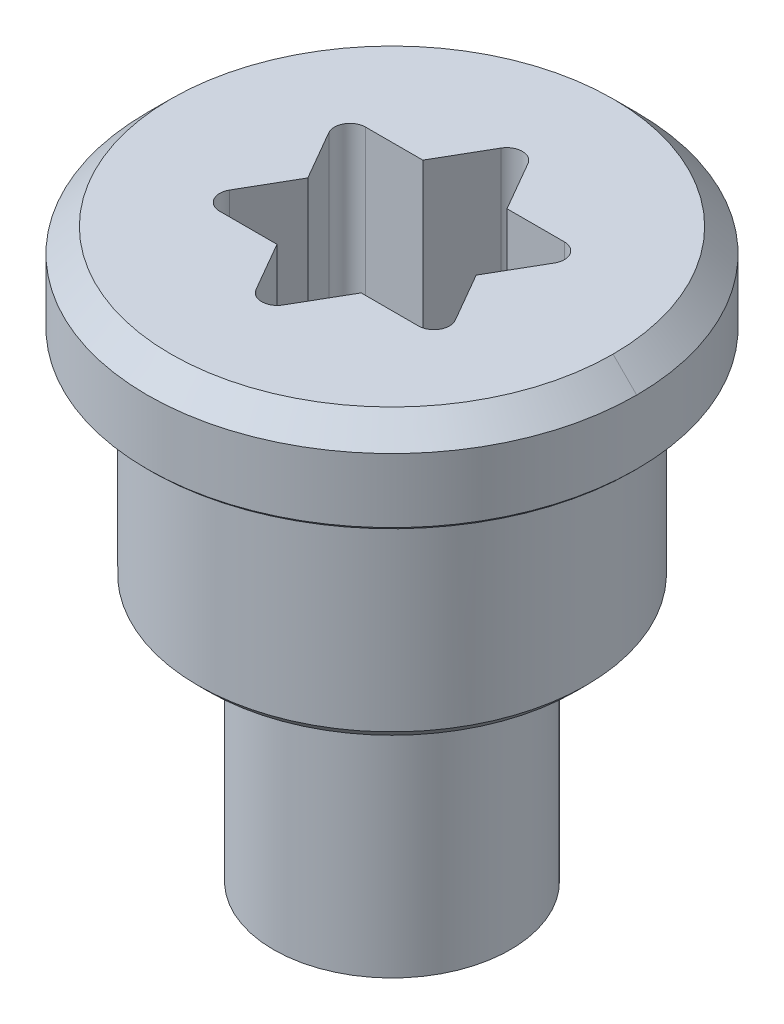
ISO-10303-21;
HEADER;
FILE_DESCRIPTION(('STEP AP214'),'2;1');
FILE_NAME('part.step','',(''),(''),'','','');
FILE_SCHEMA(('AUTOMOTIVE_DESIGN { 1 0 10303 214 1 1 1 1 }'));
ENDSEC;
DATA;
#1=APPLICATION_CONTEXT('core data for automotive mechanical design processes');
#2=APPLICATION_PROTOCOL_DEFINITION('international standard','automotive_design',2000,#1);
#3=PRODUCT_CONTEXT('',#1,'mechanical');
#4=PRODUCT('Part','Part','',(#3));
#5=PRODUCT_RELATED_PRODUCT_CATEGORY('part','',(#4));
#6=PRODUCT_DEFINITION_FORMATION('','',#4);
#7=PRODUCT_DEFINITION_CONTEXT('part definition',#1,'design');
#8=PRODUCT_DEFINITION('design','',#6,#7);
#9=PRODUCT_DEFINITION_SHAPE('','',#8);
#10=(LENGTH_UNIT() NAMED_UNIT(*) SI_UNIT(.MILLI.,.METRE.));
#11=(NAMED_UNIT(*) PLANE_ANGLE_UNIT() SI_UNIT($,.RADIAN.));
#12=(NAMED_UNIT(*) SI_UNIT($,.STERADIAN.) SOLID_ANGLE_UNIT());
#13=UNCERTAINTY_MEASURE_WITH_UNIT(LENGTH_MEASURE(1.E-05),#10,'distance_accuracy_value','');
#14=(GEOMETRIC_REPRESENTATION_CONTEXT(3) GLOBAL_UNCERTAINTY_ASSIGNED_CONTEXT((#13)) GLOBAL_UNIT_ASSIGNED_CONTEXT((#10,
#11,#12)) REPRESENTATION_CONTEXT('',''));
#15=CARTESIAN_POINT('',(0.,0.,0.));
#16=DIRECTION('',(0.,0.,1.));
#17=DIRECTION('',(1.,0.,0.));
#18=AXIS2_PLACEMENT_3D('',#15,#16,#17);
#19=CARTESIAN_POINT('',(77.52479714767,3.931380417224,-22.28021952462));
#20=DIRECTION('',(0.,0.,1.));
#21=DIRECTION('',(-1.,0.,0.));
#22=AXIS2_PLACEMENT_3D('',#19,#20,#21);
#23=PLANE('',#22);
#24=DIRECTION('',(0.,1.,0.));
#25=VECTOR('',#24,1.);
#26=CARTESIAN_POINT('',(76.6592854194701,2.631380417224,-22.2802195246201));
#27=LINE('',#26,#25);
#28=CARTESIAN_POINT('',(76.65928541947,1.381380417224,-22.28021952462));
#29=VERTEX_POINT('',#28);
#30=CARTESIAN_POINT('',(76.65928541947,3.881380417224,-22.28021952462));
#31=VERTEX_POINT('',#30);
#32=EDGE_CURVE('E213',#29,#31,#27,.T.);
#33=ORIENTED_EDGE('',*,*,#32,.T.);
#34=DIRECTION('',(-1.,0.,0.));
#35=VECTOR('',#34,1.);
#36=CARTESIAN_POINT('',(77.08355587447,3.881380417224,-22.28021952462));
#37=LINE('',#36,#35);
#38=CARTESIAN_POINT('',(77.5078263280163,3.88138041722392,-22.2802195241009));
#39=VERTEX_POINT('',#38);
#40=EDGE_CURVE('E220',#39,#31,#37,.T.);
#41=ORIENTED_EDGE('',*,*,#40,.F.);
#42=DIRECTION('',(0.,1.,0.));
#43=VECTOR('',#42,1.);
#44=CARTESIAN_POINT('',(77.5078263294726,2.631380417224,-22.2802195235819));
#45=LINE('',#44,#43);
#46=CARTESIAN_POINT('',(77.5078263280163,1.381380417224,-22.2802195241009));
#47=VERTEX_POINT('',#46);
#48=EDGE_CURVE('E185',#47,#39,#45,.T.);
#49=ORIENTED_EDGE('',*,*,#48,.F.);
#50=DIRECTION('',(1.,0.,0.));
#51=VECTOR('',#50,1.);
#52=CARTESIAN_POINT('',(77.08355587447,1.381380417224,-22.28021952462));
#53=LINE('',#52,#51);
#54=EDGE_CURVE('E180',#29,#47,#53,.T.);
#55=ORIENTED_EDGE('',*,*,#54,.F.);
#56=EDGE_LOOP('',(#33,#41,#49,#55));
#57=FACE_BOUND('',#56,.T.);
#58=ADVANCED_FACE('F15',(#57),#23,.F.);
#59=CARTESIAN_POINT('',(76.66777082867,3.931380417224,-22.29491668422));
#60=DIRECTION('',(0.866025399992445,0.,0.500000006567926));
#61=DIRECTION('',(-0.500000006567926,0.,0.866025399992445));
#62=AXIS2_PLACEMENT_3D('',#59,#60,#61);
#63=PLANE('',#62);
#64=DIRECTION('',(0.,-1.,0.));
#65=VECTOR('',#64,1.);
#66=CARTESIAN_POINT('',(76.23501495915,2.631380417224,-21.5453615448));
#67=LINE('',#66,#65);
#68=CARTESIAN_POINT('',(76.2350149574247,3.88138041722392,-21.5453615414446));
#69=VERTEX_POINT('',#68);
#70=CARTESIAN_POINT('',(76.2350149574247,1.381380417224,-21.5453615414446));
#71=VERTEX_POINT('',#70);
#72=EDGE_CURVE('E207',#69,#71,#67,.T.);
#73=ORIENTED_EDGE('',*,*,#72,.F.);
#74=DIRECTION('',(-0.500000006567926,0.,0.866025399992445));
#75=VECTOR('',#74,1.);
#76=CARTESIAN_POINT('',(76.44715018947,3.881380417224,-21.91279053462));
#77=LINE('',#76,#75);
#78=EDGE_CURVE('E211',#31,#69,#77,.T.);
#79=ORIENTED_EDGE('',*,*,#78,.F.);
#80=ORIENTED_EDGE('',*,*,#32,.F.);
#81=DIRECTION('',(0.500000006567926,0.,-0.866025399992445));
#82=VECTOR('',#81,1.);
#83=CARTESIAN_POINT('',(76.44715018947,1.381380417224,-21.91279053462));
#84=LINE('',#83,#82);
#85=EDGE_CURVE('E186',#71,#29,#84,.T.);
#86=ORIENTED_EDGE('',*,*,#85,.F.);
#87=EDGE_LOOP('',(#73,#79,#80,#86));
#88=FACE_BOUND('',#87,.T.);
#89=ADVANCED_FACE('F590',(#88),#63,.F.);
#90=CARTESIAN_POINT('',(77.50782632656,1.381380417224,-22.51036153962));
#91=DIRECTION('',(0.,1.,0.));
#92=DIRECTION('',(0.,0.,1.));
#93=AXIS2_PLACEMENT_3D('',#90,#91,#92);
#94=CYLINDRICAL_SURFACE('',#93,0.230142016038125);
#95=ORIENTED_EDGE('',*,*,#48,.T.);
#96=CARTESIAN_POINT('',(77.50782632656,3.88138041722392,-22.51036153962));
#97=DIRECTION('',(0.,1.,0.));
#98=DIRECTION('',(0.,0.,1.));
#99=AXIS2_PLACEMENT_3D('',#96,#97,#98);
#100=CIRCLE('',#99,0.230142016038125);
#101=CARTESIAN_POINT('',(77.7071351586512,3.88138041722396,-22.6254325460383));
#102=VERTEX_POINT('',#101);
#103=EDGE_CURVE('E199',#39,#102,#100,.T.);
#104=ORIENTED_EDGE('',*,*,#103,.T.);
#105=DIRECTION('',(0.,-1.,0.));
#106=VECTOR('',#105,1.);
#107=CARTESIAN_POINT('',(77.70713515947,2.631380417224,-22.62543254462));
#108=LINE('',#107,#106);
#109=CARTESIAN_POINT('',(77.7071351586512,1.381380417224,-22.6254325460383));
#110=VERTEX_POINT('',#109);
#111=EDGE_CURVE('E191',#102,#110,#108,.T.);
#112=ORIENTED_EDGE('',*,*,#111,.T.);
#113=CARTESIAN_POINT('',(77.50782632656,1.381380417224,-22.51036153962));
#114=DIRECTION('',(0.,1.,0.));
#115=DIRECTION('',(0.,0.,1.));
#116=AXIS2_PLACEMENT_3D('',#113,#114,#115);
#117=CIRCLE('',#116,0.230142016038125);
#118=EDGE_CURVE('E19',#110,#47,#117,.F.);
#119=ORIENTED_EDGE('',*,*,#118,.T.);
#120=EDGE_LOOP('',(#95,#104,#112,#119));
#121=FACE_BOUND('',#120,.T.);
#122=ADVANCED_FACE('F197',(#121),#94,.F.);
#123=CARTESIAN_POINT('',(76.03570612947,1.381380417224,-21.66043254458));
#124=DIRECTION('',(0.,1.,0.));
#125=DIRECTION('',(0.,0.,1.));
#126=AXIS2_PLACEMENT_3D('',#123,#124,#125);
#127=CYLINDRICAL_SURFACE('',#126,0.230142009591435);
#128=DIRECTION('',(0.,-1.,0.));
#129=VECTOR('',#128,1.);
#130=CARTESIAN_POINT('',(75.83639729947,2.631380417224,-21.5453615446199));
#131=LINE('',#130,#129);
#132=CARTESIAN_POINT('',(75.8363973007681,3.88138041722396,-21.5453615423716));
#133=VERTEX_POINT('',#132);
#134=CARTESIAN_POINT('',(75.8363973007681,1.381380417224,-21.5453615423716));
#135=VERTEX_POINT('',#134);
#136=EDGE_CURVE('E195',#133,#135,#131,.T.);
#137=ORIENTED_EDGE('',*,*,#136,.F.);
#138=CARTESIAN_POINT('',(76.03570612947,3.88138041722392,-21.66043254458));
#139=DIRECTION('',(0.,1.,0.));
#140=DIRECTION('',(0.,0.,1.));
#141=AXIS2_PLACEMENT_3D('',#138,#139,#140);
#142=CIRCLE('',#141,0.230142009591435);
#143=EDGE_CURVE('E202',#133,#69,#142,.T.);
#144=ORIENTED_EDGE('',*,*,#143,.T.);
#145=ORIENTED_EDGE('',*,*,#72,.T.);
#146=CARTESIAN_POINT('',(76.03570612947,1.381380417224,-21.66043254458));
#147=DIRECTION('',(0.,1.,0.));
#148=DIRECTION('',(0.,0.,1.));
#149=AXIS2_PLACEMENT_3D('',#146,#147,#148);
#150=CIRCLE('',#149,0.230142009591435);
#151=EDGE_CURVE('E210',#71,#135,#150,.F.);
#152=ORIENTED_EDGE('',*,*,#151,.T.);
#153=EDGE_LOOP('',(#137,#144,#145,#152));
#154=FACE_BOUND('',#153,.T.);
#155=ADVANCED_FACE('F324',(#154),#127,.F.);
#156=CARTESIAN_POINT('',(77.27437929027,3.931380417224,-23.37498769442));
#157=DIRECTION('',(0.866025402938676,0.,-0.500000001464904));
#158=DIRECTION('',(0.500000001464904,0.,0.866025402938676));
#159=AXIS2_PLACEMENT_3D('',#156,#157,#158);
#160=PLANE('',#159);
#161=ORIENTED_EDGE('',*,*,#111,.F.);
#162=DIRECTION('',(0.500000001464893,0.,0.866025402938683));
#163=VECTOR('',#162,1.);
#164=CARTESIAN_POINT('',(77.49499992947,3.881380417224,-22.99286153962));
#165=LINE('',#164,#163);
#166=CARTESIAN_POINT('',(77.28286469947,3.881380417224,-23.36029053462));
#167=VERTEX_POINT('',#166);
#168=EDGE_CURVE('E200',#167,#102,#165,.T.);
#169=ORIENTED_EDGE('',*,*,#168,.F.);
#170=DIRECTION('',(0.,-1.,0.));
#171=VECTOR('',#170,1.);
#172=CARTESIAN_POINT('',(77.28286469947,2.631380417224,-23.36029053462));
#173=LINE('',#172,#171);
#174=CARTESIAN_POINT('',(77.28286469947,1.381380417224,-23.36029053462));
#175=VERTEX_POINT('',#174);
#176=EDGE_CURVE('E194',#167,#175,#173,.T.);
#177=ORIENTED_EDGE('',*,*,#176,.T.);
#178=DIRECTION('',(-0.500000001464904,0.,-0.866025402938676));
#179=VECTOR('',#178,1.);
#180=CARTESIAN_POINT('',(77.49499992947,1.381380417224,-22.99286153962));
#181=LINE('',#180,#179);
#182=EDGE_CURVE('E177',#110,#175,#181,.T.);
#183=ORIENTED_EDGE('',*,*,#182,.F.);
#184=EDGE_LOOP('',(#161,#169,#177,#183));
#185=FACE_BOUND('',#184,.T.);
#186=ADVANCED_FACE('F190',(#185),#160,.F.);
#187=CARTESIAN_POINT('',(74.2105061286,-4.518619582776,-25.18549053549));
#188=DIRECTION('',(0.,-1.,0.));
#189=DIRECTION('',(1.,0.,0.));
#190=AXIS2_PLACEMENT_3D('',#187,#188,#189);
#191=PLANE('',#190);
#192=CARTESIAN_POINT('',(76.03570612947,-4.51861958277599,-23.36029053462));
#193=DIRECTION('',(0.,1.,0.));
#194=DIRECTION('',(0.,0.,1.));
#195=AXIS2_PLACEMENT_3D('',#192,#193,#194);
#196=CIRCLE('',#195,1.75500000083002);
#197=CARTESIAN_POINT('',(76.03570612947,-4.51861958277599,-21.60529053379));
#198=VERTEX_POINT('',#197);
#199=EDGE_CURVE('E313',#198,#198,#196,.F.);
#200=ORIENTED_EDGE('',*,*,#199,.T.);
#201=EDGE_LOOP('',(#200));
#202=FACE_BOUND('',#201,.T.);
#203=ADVANCED_FACE('F599',(#202),#191,.T.);
#204=CARTESIAN_POINT('',(75.84488270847,1.331380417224,-21.53066438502));
#205=DIRECTION('',(0.866025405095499,0.,-0.499999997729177));
#206=DIRECTION('',(-0.499999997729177,0.,-0.866025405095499));
#207=AXIS2_PLACEMENT_3D('',#204,#205,#206);
#208=PLANE('',#207);
#209=DIRECTION('',(0.,1.,0.));
#210=VECTOR('',#209,1.);
#211=CARTESIAN_POINT('',(75.41212684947,2.631380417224,-22.28021952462));
#212=LINE('',#211,#210);
#213=CARTESIAN_POINT('',(75.41212684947,1.381380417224,-22.28021952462));
#214=VERTEX_POINT('',#213);
#215=CARTESIAN_POINT('',(75.41212684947,3.881380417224,-22.28021952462));
#216=VERTEX_POINT('',#215);
#217=EDGE_CURVE('E316',#214,#216,#212,.T.);
#218=ORIENTED_EDGE('',*,*,#217,.T.);
#219=DIRECTION('',(0.499999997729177,0.,0.866025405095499));
#220=VECTOR('',#219,1.);
#221=CARTESIAN_POINT('',(75.62426207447,3.881380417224,-21.91279053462));
#222=LINE('',#221,#220);
#223=EDGE_CURVE('E333',#216,#133,#222,.T.);
#224=ORIENTED_EDGE('',*,*,#223,.T.);
#225=ORIENTED_EDGE('',*,*,#136,.T.);
#226=DIRECTION('',(-0.499999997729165,0.,-0.866025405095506));
#227=VECTOR('',#226,1.);
#228=CARTESIAN_POINT('',(75.62426207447,1.381380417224,-21.91279053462));
#229=LINE('',#228,#227);
#230=EDGE_CURVE('E331',#135,#214,#229,.T.);
#231=ORIENTED_EDGE('',*,*,#230,.T.);
#232=EDGE_LOOP('',(#218,#224,#225,#231));
#233=FACE_BOUND('',#232,.T.);
#234=ADVANCED_FACE('F330',(#233),#208,.T.);
#235=CARTESIAN_POINT('',(77.71562056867,3.931380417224,-24.10984568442));
#236=DIRECTION('',(0.866025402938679,0.,0.500000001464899));
#237=DIRECTION('',(-0.500000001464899,0.,0.866025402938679));
#238=AXIS2_PLACEMENT_3D('',#235,#236,#237);
#239=PLANE('',#238);
#240=ORIENTED_EDGE('',*,*,#176,.F.);
#241=DIRECTION('',(-0.500000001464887,0.,0.866025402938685));
#242=VECTOR('',#241,1.);
#243=CARTESIAN_POINT('',(77.49499992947,3.881380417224,-23.72771952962));
#244=LINE('',#243,#242);
#245=CARTESIAN_POINT('',(77.7071351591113,3.88138041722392,-24.0951485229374));
#246=VERTEX_POINT('',#245);
#247=EDGE_CURVE('E337',#246,#167,#244,.T.);
#248=ORIENTED_EDGE('',*,*,#247,.F.);
#249=DIRECTION('',(0.,1.,0.));
#250=VECTOR('',#249,1.);
#251=CARTESIAN_POINT('',(77.7071351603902,2.631380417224,-24.0951485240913));
#252=LINE('',#251,#250);
#253=CARTESIAN_POINT('',(77.7071351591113,1.381380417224,-24.0951485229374));
#254=VERTEX_POINT('',#253);
#255=EDGE_CURVE('E309',#254,#246,#252,.T.);
#256=ORIENTED_EDGE('',*,*,#255,.F.);
#257=DIRECTION('',(0.500000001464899,0.,-0.866025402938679));
#258=VECTOR('',#257,1.);
#259=CARTESIAN_POINT('',(77.49499992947,1.381380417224,-23.72771952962));
#260=LINE('',#259,#258);
#261=EDGE_CURVE('E317',#175,#254,#260,.T.);
#262=ORIENTED_EDGE('',*,*,#261,.F.);
#263=EDGE_LOOP('',(#240,#248,#256,#262));
#264=FACE_BOUND('',#263,.T.);
#265=ADVANCED_FACE('F513',(#264),#239,.F.);
#266=CARTESIAN_POINT('',(76.03570612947,-4.51861958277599,-23.36029053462));
#267=DIRECTION('',(0.,1.,0.));
#268=DIRECTION('',(0.,0.,1.));
#269=AXIS2_PLACEMENT_3D('',#266,#267,#268);
#270=CYLINDRICAL_SURFACE('',#269,1.75500000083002);
#271=CARTESIAN_POINT('',(76.03570612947,-0.718619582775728,-23.36029053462));
#272=DIRECTION('',(0.,1.,0.));
#273=DIRECTION('',(0.,0.,1.));
#274=AXIS2_PLACEMENT_3D('',#271,#272,#273);
#275=CIRCLE('',#274,1.75500000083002);
#276=CARTESIAN_POINT('',(76.03570612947,-0.718619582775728,-21.60529053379));
#277=VERTEX_POINT('',#276);
#278=EDGE_CURVE('E304',#277,#277,#275,.T.);
#279=ORIENTED_EDGE('',*,*,#278,.F.);
#280=EDGE_LOOP('',(#279));
#281=FACE_BOUND('',#280,.T.);
#282=ORIENTED_EDGE('',*,*,#199,.F.);
#283=EDGE_LOOP('',(#282));
#284=FACE_BOUND('',#283,.T.);
#285=ADVANCED_FACE('F531',(#281,#284),#270,.T.);
#286=CARTESIAN_POINT('',(75.42909766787,3.931380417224,-22.28021952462));
#287=DIRECTION('',(0.,0.,1.));
#288=DIRECTION('',(-1.,0.,0.));
#289=AXIS2_PLACEMENT_3D('',#286,#287,#288);
#290=PLANE('',#289);
#291=DIRECTION('',(0.,-1.,0.));
#292=VECTOR('',#291,1.);
#293=CARTESIAN_POINT('',(74.56358592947,2.631380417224,-22.28021952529));
#294=LINE('',#293,#292);
#295=CARTESIAN_POINT('',(74.563585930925,3.88138041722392,-22.280219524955));
#296=VERTEX_POINT('',#295);
#297=CARTESIAN_POINT('',(74.563585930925,1.381380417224,-22.280219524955));
#298=VERTEX_POINT('',#297);
#299=EDGE_CURVE('E303',#296,#298,#294,.T.);
#300=ORIENTED_EDGE('',*,*,#299,.F.);
#301=DIRECTION('',(-1.,0.,0.));
#302=VECTOR('',#301,1.);
#303=CARTESIAN_POINT('',(74.98785638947,3.881380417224,-22.28021952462));
#304=LINE('',#303,#302);
#305=EDGE_CURVE('E363',#216,#296,#304,.T.);
#306=ORIENTED_EDGE('',*,*,#305,.F.);
#307=ORIENTED_EDGE('',*,*,#217,.F.);
#308=DIRECTION('',(1.,0.,0.));
#309=VECTOR('',#308,1.);
#310=CARTESIAN_POINT('',(74.98785638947,1.381380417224,-22.28021952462));
#311=LINE('',#310,#309);
#312=EDGE_CURVE('E312',#298,#214,#311,.T.);
#313=ORIENTED_EDGE('',*,*,#312,.F.);
#314=EDGE_LOOP('',(#300,#306,#307,#313));
#315=FACE_BOUND('',#314,.T.);
#316=ADVANCED_FACE('F529',(#315),#290,.F.);
#317=CARTESIAN_POINT('',(77.50782632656,1.381380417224,-24.21021952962));
#318=DIRECTION('',(0.,1.,0.));
#319=DIRECTION('',(0.,0.,1.));
#320=AXIS2_PLACEMENT_3D('',#317,#318,#319);
#321=CYLINDRICAL_SURFACE('',#320,0.230142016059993);
#322=ORIENTED_EDGE('',*,*,#255,.T.);
#323=CARTESIAN_POINT('',(77.50782632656,3.88138041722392,-24.21021952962));
#324=DIRECTION('',(0.,1.,0.));
#325=DIRECTION('',(0.,0.,1.));
#326=AXIS2_PLACEMENT_3D('',#323,#324,#325);
#327=CIRCLE('',#326,0.230142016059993);
#328=CARTESIAN_POINT('',(77.507826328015,3.88138041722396,-24.44036154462));
#329=VERTEX_POINT('',#328);
#330=EDGE_CURVE('E307',#246,#329,#327,.T.);
#331=ORIENTED_EDGE('',*,*,#330,.T.);
#332=DIRECTION('',(0.,1.,0.));
#333=VECTOR('',#332,1.);
#334=CARTESIAN_POINT('',(77.50782632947,2.631380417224,-24.44036154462));
#335=LINE('',#334,#333);
#336=CARTESIAN_POINT('',(77.507826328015,1.381380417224,-24.44036154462));
#337=VERTEX_POINT('',#336);
#338=EDGE_CURVE('E373',#337,#329,#335,.T.);
#339=ORIENTED_EDGE('',*,*,#338,.F.);
#340=CARTESIAN_POINT('',(77.50782632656,1.381380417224,-24.21021952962));
#341=DIRECTION('',(0.,1.,0.));
#342=DIRECTION('',(0.,0.,1.));
#343=AXIS2_PLACEMENT_3D('',#340,#341,#342);
#344=CIRCLE('',#343,0.230142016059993);
#345=EDGE_CURVE('E310',#337,#254,#344,.F.);
#346=ORIENTED_EDGE('',*,*,#345,.T.);
#347=EDGE_LOOP('',(#322,#331,#339,#346));
#348=FACE_BOUND('',#347,.T.);
#349=ADVANCED_FACE('F510',(#348),#321,.F.);
#350=CARTESIAN_POINT('',(73.20170620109,-0.7186195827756,-26.194290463));
#351=DIRECTION('',(0.,-1.,0.));
#352=DIRECTION('',(1.,0.,0.));
#353=AXIS2_PLACEMENT_3D('',#350,#351,#352);
#354=PLANE('',#353);
#355=ORIENTED_EDGE('',*,*,#278,.T.);
#356=EDGE_LOOP('',(#355));
#357=FACE_BOUND('',#356,.T.);
#358=CARTESIAN_POINT('',(76.03570612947,-0.71861958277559,-23.36029053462));
#359=DIRECTION('',(0.,1.,0.));
#360=DIRECTION('',(0.,0.,1.));
#361=AXIS2_PLACEMENT_3D('',#358,#359,#360);
#362=CIRCLE('',#361,2.72499993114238);
#363=CARTESIAN_POINT('',(78.7607060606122,-0.71861958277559,-23.3602905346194));
#364=VERTEX_POINT('',#363);
#365=CARTESIAN_POINT('',(73.3107061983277,-0.71861958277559,-23.36029053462));
#366=VERTEX_POINT('',#365);
#367=EDGE_CURVE('E294',#364,#366,#362,.F.);
#368=ORIENTED_EDGE('',*,*,#367,.T.);
#369=CARTESIAN_POINT('',(76.03570612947,-0.71861958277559,-23.36029053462));
#370=DIRECTION('',(0.,1.,0.));
#371=DIRECTION('',(0.,0.,1.));
#372=AXIS2_PLACEMENT_3D('',#369,#370,#371);
#373=CIRCLE('',#372,2.72499993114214);
#374=EDGE_CURVE('E289',#366,#364,#373,.F.);
#375=ORIENTED_EDGE('',*,*,#374,.T.);
#376=EDGE_LOOP('',(#368,#375));
#377=FACE_BOUND('',#376,.T.);
#378=ADVANCED_FACE('F538',(#357,#377),#354,.T.);
#379=CARTESIAN_POINT('',(74.56358593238,1.381380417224,-22.51036153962));
#380=DIRECTION('',(0.,1.,0.));
#381=DIRECTION('',(0.,0.,1.));
#382=AXIS2_PLACEMENT_3D('',#379,#380,#381);
#383=CYLINDRICAL_SURFACE('',#382,0.230142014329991);
#384=DIRECTION('',(0.,-1.,0.));
#385=VECTOR('',#384,1.);
#386=CARTESIAN_POINT('',(74.36427709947,2.631380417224,-22.62543254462));
#387=LINE('',#386,#385);
#388=CARTESIAN_POINT('',(74.3642771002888,3.88138041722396,-22.6254325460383));
#389=VERTEX_POINT('',#388);
#390=CARTESIAN_POINT('',(74.3642771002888,1.381380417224,-22.6254325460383));
#391=VERTEX_POINT('',#390);
#392=EDGE_CURVE('E376',#389,#391,#387,.T.);
#393=ORIENTED_EDGE('',*,*,#392,.F.);
#394=CARTESIAN_POINT('',(74.56358593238,3.88138041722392,-22.51036153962));
#395=DIRECTION('',(0.,1.,0.));
#396=DIRECTION('',(0.,0.,1.));
#397=AXIS2_PLACEMENT_3D('',#394,#395,#396);
#398=CIRCLE('',#397,0.230142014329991);
#399=EDGE_CURVE('E297',#389,#296,#398,.T.);
#400=ORIENTED_EDGE('',*,*,#399,.T.);
#401=ORIENTED_EDGE('',*,*,#299,.T.);
#402=CARTESIAN_POINT('',(74.56358593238,1.381380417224,-22.51036153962));
#403=DIRECTION('',(0.,1.,0.));
#404=DIRECTION('',(0.,0.,1.));
#405=AXIS2_PLACEMENT_3D('',#402,#403,#404);
#406=CIRCLE('',#405,0.230142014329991);
#407=EDGE_CURVE('E301',#298,#391,#406,.F.);
#408=ORIENTED_EDGE('',*,*,#407,.T.);
#409=EDGE_LOOP('',(#393,#400,#401,#408));
#410=FACE_BOUND('',#409,.T.);
#411=ADVANCED_FACE('F526',(#410),#383,.F.);
#412=CARTESIAN_POINT('',(76.64231460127,1.331380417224,-24.44036154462));
#413=DIRECTION('',(0.,0.,1.));
#414=DIRECTION('',(1.,0.,0.));
#415=AXIS2_PLACEMENT_3D('',#412,#413,#414);
#416=PLANE('',#415);
#417=ORIENTED_EDGE('',*,*,#338,.T.);
#418=DIRECTION('',(-1.,0.,0.));
#419=VECTOR('',#418,1.);
#420=CARTESIAN_POINT('',(77.08355587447,3.881380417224,-24.44036154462));
#421=LINE('',#420,#419);
#422=CARTESIAN_POINT('',(76.65928541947,3.881380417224,-24.44036154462));
#423=VERTEX_POINT('',#422);
#424=EDGE_CURVE('E296',#329,#423,#421,.T.);
#425=ORIENTED_EDGE('',*,*,#424,.T.);
#426=DIRECTION('',(0.,-1.,0.));
#427=VECTOR('',#426,1.);
#428=CARTESIAN_POINT('',(76.65928541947,2.631380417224,-24.4403615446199));
#429=LINE('',#428,#427);
#430=CARTESIAN_POINT('',(76.65928541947,1.381380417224,-24.44036154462));
#431=VERTEX_POINT('',#430);
#432=EDGE_CURVE('E388',#423,#431,#429,.T.);
#433=ORIENTED_EDGE('',*,*,#432,.T.);
#434=DIRECTION('',(1.,0.,0.));
#435=VECTOR('',#434,1.);
#436=CARTESIAN_POINT('',(77.08355587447,1.381380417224,-24.44036154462));
#437=LINE('',#436,#435);
#438=EDGE_CURVE('E300',#431,#337,#437,.T.);
#439=ORIENTED_EDGE('',*,*,#438,.T.);
#440=EDGE_LOOP('',(#417,#425,#433,#439));
#441=FACE_BOUND('',#440,.T.);
#442=ADVANCED_FACE('F505',(#441),#416,.T.);
#443=CARTESIAN_POINT('',(76.03570612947,-0.71861958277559,-23.36029053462));
#444=DIRECTION('',(0.,1.,0.));
#445=DIRECTION('',(0.,0.,1.));
#446=AXIS2_PLACEMENT_3D('',#443,#444,#445);
#447=CONICAL_SURFACE('',#446,2.72499993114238,0.785398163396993);
#448=ORIENTED_EDGE('',*,*,#367,.F.);
#449=DIRECTION('',(0.707106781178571,0.707106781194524,1.42134599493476E-13));
#450=VECTOR('',#449,1.);
#451=CARTESIAN_POINT('',(78.8357060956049,-0.64361954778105,-23.3602905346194));
#452=LINE('',#451,#450);
#453=CARTESIAN_POINT('',(78.9107061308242,-0.568619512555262,-23.3602905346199));
#454=VERTEX_POINT('',#453);
#455=EDGE_CURVE('E292',#364,#454,#452,.T.);
#456=ORIENTED_EDGE('',*,*,#455,.T.);
#457=CARTESIAN_POINT('',(76.03570612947,-0.568619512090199,-23.36029053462));
#458=DIRECTION('',(0.,1.,0.));
#459=DIRECTION('',(-1.,0.,0.));
#460=AXIS2_PLACEMENT_3D('',#457,#458,#459);
#461=CIRCLE('',#460,2.87500000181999);
#462=CARTESIAN_POINT('',(73.160706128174,-0.568619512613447,-23.3602905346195));
#463=VERTEX_POINT('',#462);
#464=EDGE_CURVE('E405',#454,#463,#461,.F.);
#465=ORIENTED_EDGE('',*,*,#464,.T.);
#466=DIRECTION('',(0.707106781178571,-0.707106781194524,0.));
#467=VECTOR('',#466,1.);
#468=CARTESIAN_POINT('',(73.235706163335,-0.64361954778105,-23.36029053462));
#469=LINE('',#468,#467);
#470=EDGE_CURVE('E293',#463,#366,#469,.T.);
#471=ORIENTED_EDGE('',*,*,#470,.T.);
#472=EDGE_LOOP('',(#448,#456,#465,#471));
#473=FACE_BOUND('',#472,.T.);
#474=ADVANCED_FACE('F579',(#473),#447,.T.);
#475=CARTESIAN_POINT('',(76.03570612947,-0.718619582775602,-23.36029053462));
#476=DIRECTION('',(0.,1.,0.));
#477=DIRECTION('',(0.,0.,1.));
#478=AXIS2_PLACEMENT_3D('',#475,#476,#477);
#479=CONICAL_SURFACE('',#478,2.72499993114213,0.78539816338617);
#480=ORIENTED_EDGE('',*,*,#455,.F.);
#481=ORIENTED_EDGE('',*,*,#374,.F.);
#482=ORIENTED_EDGE('',*,*,#470,.F.);
#483=CARTESIAN_POINT('',(76.03570612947,-0.568619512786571,-23.36029053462));
#484=DIRECTION('',(0.,1.,0.));
#485=DIRECTION('',(1.,0.,0.));
#486=AXIS2_PLACEMENT_3D('',#483,#484,#485);
#487=CIRCLE('',#486,2.87500000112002);
#488=EDGE_CURVE('E286',#463,#454,#487,.F.);
#489=ORIENTED_EDGE('',*,*,#488,.T.);
#490=EDGE_LOOP('',(#480,#481,#482,#489));
#491=FACE_BOUND('',#490,.T.);
#492=ADVANCED_FACE('F576',(#491),#479,.T.);
#493=CARTESIAN_POINT('',(74.35579169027,1.331380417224,-22.61073538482));
#494=DIRECTION('',(0.866025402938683,0.,0.500000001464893));
#495=DIRECTION('',(0.500000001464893,0.,-0.866025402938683));
#496=AXIS2_PLACEMENT_3D('',#493,#494,#495);
#497=PLANE('',#496);
#498=DIRECTION('',(0.,-1.,0.));
#499=VECTOR('',#498,1.);
#500=CARTESIAN_POINT('',(74.78854755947,2.631380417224,-23.36029053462));
#501=LINE('',#500,#499);
#502=CARTESIAN_POINT('',(74.78854755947,3.881380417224,-23.36029053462));
#503=VERTEX_POINT('',#502);
#504=CARTESIAN_POINT('',(74.78854755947,1.381380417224,-23.36029053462));
#505=VERTEX_POINT('',#504);
#506=EDGE_CURVE('E280',#503,#505,#501,.T.);
#507=ORIENTED_EDGE('',*,*,#506,.F.);
#508=DIRECTION('',(-0.500000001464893,0.,0.866025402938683));
#509=VECTOR('',#508,1.);
#510=CARTESIAN_POINT('',(74.57641232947,3.881380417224,-22.99286153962));
#511=LINE('',#510,#509);
#512=EDGE_CURVE('E413',#503,#389,#511,.T.);
#513=ORIENTED_EDGE('',*,*,#512,.T.);
#514=ORIENTED_EDGE('',*,*,#392,.T.);
#515=DIRECTION('',(0.500000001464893,0.,-0.866025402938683));
#516=VECTOR('',#515,1.);
#517=CARTESIAN_POINT('',(74.57641232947,1.381380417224,-22.99286153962));
#518=LINE('',#517,#516);
#519=EDGE_CURVE('E379',#391,#505,#518,.T.);
#520=ORIENTED_EDGE('',*,*,#519,.T.);
#521=EDGE_LOOP('',(#507,#513,#514,#520));
#522=FACE_BOUND('',#521,.T.);
#523=ADVANCED_FACE('F523',(#522),#497,.T.);
#524=CARTESIAN_POINT('',(76.22652955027,3.931380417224,-25.18991668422));
#525=DIRECTION('',(0.866025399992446,0.,-0.500000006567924));
#526=DIRECTION('',(0.500000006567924,0.,0.866025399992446));
#527=AXIS2_PLACEMENT_3D('',#524,#525,#526);
#528=PLANE('',#527);
#529=ORIENTED_EDGE('',*,*,#432,.F.);
#530=DIRECTION('',(0.500000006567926,0.,0.866025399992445));
#531=VECTOR('',#530,1.);
#532=CARTESIAN_POINT('',(76.44715018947,3.881380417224,-24.80779053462));
#533=LINE('',#532,#531);
#534=CARTESIAN_POINT('',(76.2350149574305,3.88138041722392,-25.175219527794));
#535=VERTEX_POINT('',#534);
#536=EDGE_CURVE('E392',#535,#423,#533,.T.);
#537=ORIENTED_EDGE('',*,*,#536,.F.);
#538=DIRECTION('',(0.,1.,0.));
#539=VECTOR('',#538,1.);
#540=CARTESIAN_POINT('',(76.2350149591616,2.631380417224,-25.1752195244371));
#541=LINE('',#540,#539);
#542=CARTESIAN_POINT('',(76.2350149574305,1.381380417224,-25.175219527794));
#543=VERTEX_POINT('',#542);
#544=EDGE_CURVE('E277',#543,#535,#541,.T.);
#545=ORIENTED_EDGE('',*,*,#544,.F.);
#546=DIRECTION('',(-0.500000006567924,0.,-0.866025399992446));
#547=VECTOR('',#546,1.);
#548=CARTESIAN_POINT('',(76.44715018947,1.381380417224,-24.80779053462));
#549=LINE('',#548,#547);
#550=EDGE_CURVE('E391',#431,#543,#549,.T.);
#551=ORIENTED_EDGE('',*,*,#550,.F.);
#552=EDGE_LOOP('',(#529,#537,#545,#551));
#553=FACE_BOUND('',#552,.T.);
#554=ADVANCED_FACE('F502',(#553),#528,.F.);
#555=CARTESIAN_POINT('',(76.03570612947,-0.568619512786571,-23.36029053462));
#556=DIRECTION('',(0.,1.,0.));
#557=DIRECTION('',(0.,0.,1.));
#558=AXIS2_PLACEMENT_3D('',#555,#556,#557);
#559=CYLINDRICAL_SURFACE('',#558,2.87500000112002);
#560=CARTESIAN_POINT('',(76.03570612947,2.53138041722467,-23.36029053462));
#561=DIRECTION('',(0.,1.,0.));
#562=DIRECTION('',(0.,0.,1.));
#563=AXIS2_PLACEMENT_3D('',#560,#561,#562);
#564=CIRCLE('',#563,2.87500000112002);
#565=CARTESIAN_POINT('',(76.03570612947,2.53138041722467,-20.4852905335));
#566=VERTEX_POINT('',#565);
#567=EDGE_CURVE('E266',#566,#566,#564,.F.);
#568=ORIENTED_EDGE('',*,*,#567,.T.);
#569=EDGE_LOOP('',(#568));
#570=FACE_BOUND('',#569,.T.);
#571=ORIENTED_EDGE('',*,*,#488,.F.);
#572=ORIENTED_EDGE('',*,*,#464,.F.);
#573=EDGE_LOOP('',(#571,#572));
#574=FACE_BOUND('',#573,.T.);
#575=ADVANCED_FACE('F571',(#570,#574),#559,.T.);
#576=CARTESIAN_POINT('',(76.0357061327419,2.53138052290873,-23.3602905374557));
#577=DIRECTION('',(-5.54400138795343E-08,0.999999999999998,4.43900020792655E-08));
#578=DIRECTION('',(-0.999999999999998,-5.54400138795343E-08,0.));
#579=AXIS2_PLACEMENT_3D('',#576,#577,#578);
#580=CONICAL_SURFACE('',#579,3.57500147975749,0.785398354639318);
#581=CARTESIAN_POINT('',(76.03570612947,2.58137891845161,-23.36029053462));
#582=DIRECTION('',(0.,1.,0.));
#583=DIRECTION('',(-1.,0.,0.));
#584=AXIS2_PLACEMENT_3D('',#581,#582,#583);
#585=CIRCLE('',#584,3.62500000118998);
#586=CARTESIAN_POINT('',(79.6607060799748,2.58137907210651,-23.3602905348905));
#587=VERTEX_POINT('',#586);
#588=CARTESIAN_POINT('',(72.4107061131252,2.58137887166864,-23.3602905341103));
#589=VERTEX_POINT('',#588);
#590=EDGE_CURVE('E269',#587,#589,#585,.F.);
#591=ORIENTED_EDGE('',*,*,#590,.T.);
#592=DIRECTION('',(-0.707106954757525,0.707106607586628,-6.39305422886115E-06));
#593=VECTOR('',#592,1.);
#594=CARTESIAN_POINT('',(72.461011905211,2.53107307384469,-23.3603226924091));
#595=LINE('',#594,#593);
#596=CARTESIAN_POINT('',(72.4607055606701,2.53137942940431,-23.3602905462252));
#597=VERTEX_POINT('',#596);
#598=EDGE_CURVE('E281',#597,#589,#595,.T.);
#599=ORIENTED_EDGE('',*,*,#598,.F.);
#600=CARTESIAN_POINT('',(76.0357061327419,2.53138052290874,-23.3602905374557));
#601=DIRECTION('',(-5.54400138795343E-08,0.999999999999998,4.43900020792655E-08));
#602=DIRECTION('',(-0.999999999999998,-5.54400138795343E-08,0.));
#603=AXIS2_PLACEMENT_3D('',#600,#601,#602);
#604=CIRCLE('',#603,3.57500147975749);
#605=CARTESIAN_POINT('',(79.6107049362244,2.53137806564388,-23.3602906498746));
#606=VERTEX_POINT('',#605);
#607=EDGE_CURVE('E270',#597,#606,#604,.T.);
#608=ORIENTED_EDGE('',*,*,#607,.T.);
#609=DIRECTION('',(0.707106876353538,0.707106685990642,-6.39323994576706E-06));
#610=VECTOR('',#609,1.);
#611=CARTESIAN_POINT('',(79.6104003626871,2.53107347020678,-23.360322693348));
#612=LINE('',#611,#610);
#613=EDGE_CURVE('E278',#587,#606,#612,.F.);
#614=ORIENTED_EDGE('',*,*,#613,.F.);
#615=EDGE_LOOP('',(#591,#599,#608,#614));
#616=FACE_BOUND('',#615,.T.);
#617=ADVANCED_FACE('F568',(#616),#580,.T.);
#618=CARTESIAN_POINT('',(74.79703296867,1.331380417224,-23.34559337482));
#619=DIRECTION('',(0.866025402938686,0.,-0.500000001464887));
#620=DIRECTION('',(-0.500000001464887,0.,-0.866025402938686));
#621=AXIS2_PLACEMENT_3D('',#618,#619,#620);
#622=PLANE('',#621);
#623=DIRECTION('',(0.,-1.,0.));
#624=VECTOR('',#623,1.);
#625=CARTESIAN_POINT('',(74.3642771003,2.631380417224,-24.0951485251));
#626=LINE('',#625,#624);
#627=CARTESIAN_POINT('',(74.3642771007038,3.88138041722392,-24.0951485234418));
#628=VERTEX_POINT('',#627);
#629=CARTESIAN_POINT('',(74.3642771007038,1.381380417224,-24.0951485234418));
#630=VERTEX_POINT('',#629);
#631=EDGE_CURVE('E265',#628,#630,#626,.T.);
#632=ORIENTED_EDGE('',*,*,#631,.F.);
#633=DIRECTION('',(0.500000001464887,0.,0.866025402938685));
#634=VECTOR('',#633,1.);
#635=CARTESIAN_POINT('',(74.57641232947,3.881380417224,-23.72771952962));
#636=LINE('',#635,#634);
#637=EDGE_CURVE('E437',#628,#503,#636,.T.);
#638=ORIENTED_EDGE('',*,*,#637,.T.);
#639=ORIENTED_EDGE('',*,*,#506,.T.);
#640=DIRECTION('',(-0.500000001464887,0.,-0.866025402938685));
#641=VECTOR('',#640,1.);
#642=CARTESIAN_POINT('',(74.57641232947,1.381380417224,-23.72771952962));
#643=LINE('',#642,#641);
#644=EDGE_CURVE('E422',#505,#630,#643,.T.);
#645=ORIENTED_EDGE('',*,*,#644,.T.);
#646=EDGE_LOOP('',(#632,#638,#639,#645));
#647=FACE_BOUND('',#646,.T.);
#648=ADVANCED_FACE('F520',(#647),#622,.T.);
#649=CARTESIAN_POINT('',(76.03570612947,1.381380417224,-25.06014852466));
#650=DIRECTION('',(0.,1.,0.));
#651=DIRECTION('',(0.,0.,1.));
#652=AXIS2_PLACEMENT_3D('',#649,#650,#651);
#653=CYLINDRICAL_SURFACE('',#652,0.230142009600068);
#654=ORIENTED_EDGE('',*,*,#544,.T.);
#655=CARTESIAN_POINT('',(76.03570612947,3.88138041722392,-25.06014852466));
#656=DIRECTION('',(0.,1.,0.));
#657=DIRECTION('',(0.,0.,1.));
#658=AXIS2_PLACEMENT_3D('',#655,#656,#657);
#659=CIRCLE('',#658,0.230142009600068);
#660=CARTESIAN_POINT('',(75.8363973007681,3.88138041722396,-25.1752195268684));
#661=VERTEX_POINT('',#660);
#662=EDGE_CURVE('E273',#535,#661,#659,.T.);
#663=ORIENTED_EDGE('',*,*,#662,.T.);
#664=DIRECTION('',(0.,1.,0.));
#665=VECTOR('',#664,1.);
#666=CARTESIAN_POINT('',(75.83639729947,2.631380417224,-25.1752195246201));
#667=LINE('',#666,#665);
#668=CARTESIAN_POINT('',(75.8363973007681,1.381380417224,-25.1752195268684));
#669=VERTEX_POINT('',#668);
#670=EDGE_CURVE('E446',#669,#661,#667,.T.);
#671=ORIENTED_EDGE('',*,*,#670,.F.);
#672=CARTESIAN_POINT('',(76.03570612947,1.381380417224,-25.06014852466));
#673=DIRECTION('',(0.,1.,0.));
#674=DIRECTION('',(0.,0.,1.));
#675=AXIS2_PLACEMENT_3D('',#672,#673,#674);
#676=CIRCLE('',#675,0.230142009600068);
#677=EDGE_CURVE('E256',#543,#669,#676,.T.);
#678=ORIENTED_EDGE('',*,*,#677,.F.);
#679=EDGE_LOOP('',(#654,#663,#671,#678));
#680=FACE_BOUND('',#679,.T.);
#681=ADVANCED_FACE('F497',(#680),#653,.F.);
#682=CARTESIAN_POINT('',(72.31770567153,2.531380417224,-19.64228894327));
#683=DIRECTION('',(0.,1.,0.));
#684=DIRECTION('',(1.,0.,0.));
#685=AXIS2_PLACEMENT_3D('',#682,#683,#684);
#686=PLANE('',#685);
#687=ORIENTED_EDGE('',*,*,#567,.F.);
#688=EDGE_LOOP('',(#687));
#689=FACE_BOUND('',#688,.T.);
#690=CARTESIAN_POINT('',(76.0357059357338,2.531380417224,-23.3602906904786));
#691=DIRECTION('',(0.,1.,0.));
#692=DIRECTION('',(0.,0.,1.));
#693=AXIS2_PLACEMENT_3D('',#690,#691,#692);
#694=CIRCLE('',#693,3.57500137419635);
#695=EDGE_CURVE('E250',#597,#606,#694,.F.);
#696=ORIENTED_EDGE('',*,*,#695,.T.);
#697=ORIENTED_EDGE('',*,*,#607,.F.);
#698=EDGE_LOOP('',(#696,#697));
#699=FACE_BOUND('',#698,.T.);
#700=ADVANCED_FACE('F565',(#689,#699),#686,.F.);
#701=CARTESIAN_POINT('',(74.56358593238,1.381380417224,-24.21021952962));
#702=DIRECTION('',(0.,1.,0.));
#703=DIRECTION('',(0.,0.,1.));
#704=AXIS2_PLACEMENT_3D('',#701,#702,#703);
#705=CYLINDRICAL_SURFACE('',#704,0.230142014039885);
#706=DIRECTION('',(0.,-1.,0.));
#707=VECTOR('',#706,1.);
#708=CARTESIAN_POINT('',(74.56358592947,2.631380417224,-24.44036154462));
#709=LINE('',#708,#707);
#710=CARTESIAN_POINT('',(74.563585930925,3.88138041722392,-24.4403615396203));
#711=VERTEX_POINT('',#710);
#712=CARTESIAN_POINT('',(74.563585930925,1.381380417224,-24.44036154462));
#713=VERTEX_POINT('',#712);
#714=EDGE_CURVE('E243',#711,#713,#709,.T.);
#715=ORIENTED_EDGE('',*,*,#714,.F.);
#716=CARTESIAN_POINT('',(74.56358593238,3.88138041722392,-24.21021952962));
#717=DIRECTION('',(0.,1.,0.));
#718=DIRECTION('',(0.,0.,1.));
#719=AXIS2_PLACEMENT_3D('',#716,#717,#718);
#720=CIRCLE('',#719,0.230142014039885);
#721=EDGE_CURVE('E262',#711,#628,#720,.T.);
#722=ORIENTED_EDGE('',*,*,#721,.T.);
#723=ORIENTED_EDGE('',*,*,#631,.T.);
#724=CARTESIAN_POINT('',(74.56358593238,1.381380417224,-24.21021952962));
#725=DIRECTION('',(0.,1.,0.));
#726=DIRECTION('',(0.,0.,1.));
#727=AXIS2_PLACEMENT_3D('',#724,#725,#726);
#728=CIRCLE('',#727,0.230142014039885);
#729=EDGE_CURVE('E259',#713,#630,#728,.T.);
#730=ORIENTED_EDGE('',*,*,#729,.F.);
#731=EDGE_LOOP('',(#715,#722,#723,#730));
#732=FACE_BOUND('',#731,.T.);
#733=ADVANCED_FACE('F517',(#732),#705,.F.);
#734=CARTESIAN_POINT('',(74.2653534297,1.381380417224,-21.35309053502));
#735=DIRECTION('',(0.,1.,0.));
#736=DIRECTION('',(1.,0.,0.));
#737=AXIS2_PLACEMENT_3D('',#734,#735,#736);
#738=PLANE('',#737);
#739=ORIENTED_EDGE('',*,*,#550,.T.);
#740=ORIENTED_EDGE('',*,*,#677,.T.);
#741=DIRECTION('',(0.499999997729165,0.,-0.866025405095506));
#742=VECTOR('',#741,1.);
#743=CARTESIAN_POINT('',(75.62426207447,1.381380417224,-24.80779053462));
#744=LINE('',#743,#742);
#745=CARTESIAN_POINT('',(75.41212684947,1.381380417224,-24.44036154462));
#746=VERTEX_POINT('',#745);
#747=EDGE_CURVE('E258',#746,#669,#744,.T.);
#748=ORIENTED_EDGE('',*,*,#747,.F.);
#749=DIRECTION('',(1.,0.,0.));
#750=VECTOR('',#749,1.);
#751=CARTESIAN_POINT('',(74.98785638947,1.381380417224,-24.44036154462));
#752=LINE('',#751,#750);
#753=EDGE_CURVE('E455',#713,#746,#752,.T.);
#754=ORIENTED_EDGE('',*,*,#753,.F.);
#755=ORIENTED_EDGE('',*,*,#729,.T.);
#756=ORIENTED_EDGE('',*,*,#644,.F.);
#757=ORIENTED_EDGE('',*,*,#519,.F.);
#758=ORIENTED_EDGE('',*,*,#407,.F.);
#759=ORIENTED_EDGE('',*,*,#312,.T.);
#760=ORIENTED_EDGE('',*,*,#230,.F.);
#761=ORIENTED_EDGE('',*,*,#151,.F.);
#762=ORIENTED_EDGE('',*,*,#85,.T.);
#763=ORIENTED_EDGE('',*,*,#54,.T.);
#764=ORIENTED_EDGE('',*,*,#118,.F.);
#765=ORIENTED_EDGE('',*,*,#182,.T.);
#766=ORIENTED_EDGE('',*,*,#261,.T.);
#767=ORIENTED_EDGE('',*,*,#345,.F.);
#768=ORIENTED_EDGE('',*,*,#438,.F.);
#769=EDGE_LOOP('',(#739,#740,#748,#754,#755,#756,#757,#758,#759,#760,#761,#762,#763,#764,#765,
#766,#767,#768));
#770=FACE_BOUND('',#769,.T.);
#771=ADVANCED_FACE('F175',(#770),#738,.T.);
#772=CARTESIAN_POINT('',(75.40364144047,1.331380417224,-24.42566438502));
#773=DIRECTION('',(0.8660254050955,0.,0.499999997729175));
#774=DIRECTION('',(0.499999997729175,0.,-0.8660254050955));
#775=AXIS2_PLACEMENT_3D('',#772,#773,#774);
#776=PLANE('',#775);
#777=ORIENTED_EDGE('',*,*,#670,.T.);
#778=DIRECTION('',(-0.499999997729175,0.,0.8660254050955));
#779=VECTOR('',#778,1.);
#780=CARTESIAN_POINT('',(75.62426207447,3.881380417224,-24.80779053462));
#781=LINE('',#780,#779);
#782=CARTESIAN_POINT('',(75.41212684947,3.881380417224,-24.4403615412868));
#783=VERTEX_POINT('',#782);
#784=EDGE_CURVE('E253',#661,#783,#781,.T.);
#785=ORIENTED_EDGE('',*,*,#784,.T.);
#786=DIRECTION('',(0.,1.,0.));
#787=VECTOR('',#786,1.);
#788=CARTESIAN_POINT('',(75.41212684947,2.631380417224,-24.44036154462));
#789=LINE('',#788,#787);
#790=EDGE_CURVE('E457',#746,#783,#789,.T.);
#791=ORIENTED_EDGE('',*,*,#790,.F.);
#792=ORIENTED_EDGE('',*,*,#747,.T.);
#793=EDGE_LOOP('',(#777,#785,#791,#792));
#794=FACE_BOUND('',#793,.T.);
#795=ADVANCED_FACE('F493',(#794),#776,.T.);
#796=CARTESIAN_POINT('',(76.035706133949,2.53107327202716,-23.3602905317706));
#797=DIRECTION('',(-5.54399996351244E-08,0.999999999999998,-4.43899986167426E-08));
#798=DIRECTION('',(-0.999999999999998,-5.54399996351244E-08,0.));
#799=AXIS2_PLACEMENT_3D('',#796,#797,#798);
#800=CONICAL_SURFACE('',#799,3.57469422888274,0.785398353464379);
#801=CARTESIAN_POINT('',(76.03570612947,2.5813789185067,-23.36029053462));
#802=DIRECTION('',(0.,1.,0.));
#803=DIRECTION('',(1.,0.,0.));
#804=AXIS2_PLACEMENT_3D('',#801,#802,#803);
#805=CIRCLE('',#804,3.62500000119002);
#806=EDGE_CURVE('E237',#589,#587,#805,.F.);
#807=ORIENTED_EDGE('',*,*,#806,.T.);
#808=ORIENTED_EDGE('',*,*,#613,.T.);
#809=ORIENTED_EDGE('',*,*,#695,.F.);
#810=ORIENTED_EDGE('',*,*,#598,.T.);
#811=EDGE_LOOP('',(#807,#808,#809,#810));
#812=FACE_BOUND('',#811,.T.);
#813=ADVANCED_FACE('F558',(#812),#800,.T.);
#814=CARTESIAN_POINT('',(76.035706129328,3.881380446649,-23.3602905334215));
#815=DIRECTION('',(-8.80004172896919E-10,-1.,-1.34600005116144E-08));
#816=DIRECTION('',(0.,1.34600005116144E-08,-1.));
#817=AXIS2_PLACEMENT_3D('',#814,#815,#816);
#818=CONICAL_SURFACE('',#817,3.27500093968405,0.785398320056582);
#819=CARTESIAN_POINT('',(76.035706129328,3.881380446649,-23.3602905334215));
#820=DIRECTION('',(-8.80004172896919E-10,-1.,-1.34600005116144E-08));
#821=DIRECTION('',(0.,1.34600005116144E-08,-1.));
#822=AXIS2_PLACEMENT_3D('',#819,#820,#821);
#823=CIRCLE('',#822,3.27500093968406);
#824=CARTESIAN_POINT('',(72.760705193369,3.88138044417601,-23.3602905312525));
#825=VERTEX_POINT('',#824);
#826=CARTESIAN_POINT('',(79.3107070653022,3.88138044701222,-23.3602905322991));
#827=VERTEX_POINT('',#826);
#828=EDGE_CURVE('E233',#825,#827,#823,.F.);
#829=ORIENTED_EDGE('',*,*,#828,.F.);
#830=DIRECTION('',(-0.707106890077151,-0.707106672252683,-7.82028383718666E-06));
#831=VECTOR('',#830,1.);
#832=CARTESIAN_POINT('',(72.7607051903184,3.88138043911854,-23.3603267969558));
#833=LINE('',#832,#831);
#834=CARTESIAN_POINT('',(72.4107061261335,3.53138148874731,-23.3602860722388));
#835=VERTEX_POINT('',#834);
#836=EDGE_CURVE('E34',#835,#825,#833,.F.);
#837=ORIENTED_EDGE('',*,*,#836,.F.);
#838=CARTESIAN_POINT('',(76.03570612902,3.53138149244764,-23.3602905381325));
#839=DIRECTION('',(-8.80004402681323E-10,-1.,-1.34600004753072E-08));
#840=DIRECTION('',(0.996951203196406,1.72929558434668E-10,-0.0780275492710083));
#841=AXIS2_PLACEMENT_3D('',#838,#839,#840);
#842=CIRCLE('',#841,3.6250000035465);
#843=CARTESIAN_POINT('',(79.6607061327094,3.53138149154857,-23.3602860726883));
#844=VERTEX_POINT('',#843);
#845=EDGE_CURVE('E247',#844,#835,#842,.T.);
#846=ORIENTED_EDGE('',*,*,#845,.F.);
#847=DIRECTION('',(0.707106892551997,-0.707106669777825,-7.82131728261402E-06));
#848=VECTOR('',#847,1.);
#849=CARTESIAN_POINT('',(79.310707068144,3.88138045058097,-23.3603268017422));
#850=LINE('',#849,#848);
#851=EDGE_CURVE('E240',#827,#844,#850,.T.);
#852=ORIENTED_EDGE('',*,*,#851,.F.);
#853=EDGE_LOOP('',(#829,#837,#846,#852));
#854=FACE_BOUND('',#853,.T.);
#855=ADVANCED_FACE('F555',(#854),#818,.T.);
#856=CARTESIAN_POINT('',(74.54661511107,1.331380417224,-24.44036154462));
#857=DIRECTION('',(0.,0.,1.));
#858=DIRECTION('',(1.,0.,0.));
#859=AXIS2_PLACEMENT_3D('',#856,#857,#858);
#860=PLANE('',#859);
#861=ORIENTED_EDGE('',*,*,#790,.T.);
#862=DIRECTION('',(1.,0.,0.));
#863=VECTOR('',#862,1.);
#864=CARTESIAN_POINT('',(76.03570613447,3.881380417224,-24.4403615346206));
#865=LINE('',#864,#863);
#866=EDGE_CURVE('E236',#711,#783,#865,.T.);
#867=ORIENTED_EDGE('',*,*,#866,.F.);
#868=ORIENTED_EDGE('',*,*,#714,.T.);
#869=ORIENTED_EDGE('',*,*,#753,.T.);
#870=EDGE_LOOP('',(#861,#867,#868,#869));
#871=FACE_BOUND('',#870,.T.);
#872=ADVANCED_FACE('F487',(#871),#860,.T.);
#873=CARTESIAN_POINT('',(76.03570612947,2.5813789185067,-23.36029053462));
#874=DIRECTION('',(0.,1.,0.));
#875=DIRECTION('',(0.,0.,1.));
#876=AXIS2_PLACEMENT_3D('',#873,#874,#875);
#877=CYLINDRICAL_SURFACE('',#876,3.62500000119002);
#878=ORIENTED_EDGE('',*,*,#845,.T.);
#879=CARTESIAN_POINT('',(76.0357061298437,3.53138148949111,-23.3602905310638));
#880=DIRECTION('',(1.7499890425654E-09,-1.,1.26500025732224E-08));
#881=DIRECTION('',(-0.996951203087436,-7.57604706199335E-10,0.0780275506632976));
#882=AXIS2_PLACEMENT_3D('',#879,#880,#881);
#883=CIRCLE('',#882,3.62500000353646);
#884=EDGE_CURVE('E25',#835,#844,#883,.T.);
#885=ORIENTED_EDGE('',*,*,#884,.T.);
#886=EDGE_LOOP('',(#878,#885));
#887=FACE_BOUND('',#886,.T.);
#888=ORIENTED_EDGE('',*,*,#806,.F.);
#889=ORIENTED_EDGE('',*,*,#590,.F.);
#890=EDGE_LOOP('',(#888,#889));
#891=FACE_BOUND('',#890,.T.);
#892=ADVANCED_FACE('F550',(#887,#891),#877,.T.);
#893=CARTESIAN_POINT('',(79.44170649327,3.881380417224,-26.76909692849));
#894=DIRECTION('',(0.,1.,0.));
#895=DIRECTION('',(-1.,0.,0.));
#896=AXIS2_PLACEMENT_3D('',#893,#894,#895);
#897=PLANE('',#896);
#898=ORIENTED_EDGE('',*,*,#721,.F.);
#899=ORIENTED_EDGE('',*,*,#866,.T.);
#900=ORIENTED_EDGE('',*,*,#784,.F.);
#901=ORIENTED_EDGE('',*,*,#662,.F.);
#902=ORIENTED_EDGE('',*,*,#536,.T.);
#903=ORIENTED_EDGE('',*,*,#424,.F.);
#904=ORIENTED_EDGE('',*,*,#330,.F.);
#905=ORIENTED_EDGE('',*,*,#247,.T.);
#906=ORIENTED_EDGE('',*,*,#168,.T.);
#907=ORIENTED_EDGE('',*,*,#103,.F.);
#908=ORIENTED_EDGE('',*,*,#40,.T.);
#909=ORIENTED_EDGE('',*,*,#78,.T.);
#910=ORIENTED_EDGE('',*,*,#143,.F.);
#911=ORIENTED_EDGE('',*,*,#223,.F.);
#912=ORIENTED_EDGE('',*,*,#305,.T.);
#913=ORIENTED_EDGE('',*,*,#399,.F.);
#914=ORIENTED_EDGE('',*,*,#512,.F.);
#915=ORIENTED_EDGE('',*,*,#637,.F.);
#916=EDGE_LOOP('',(#898,#899,#900,#901,#902,#903,#904,#905,#906,#907,#908,#909,#910,#911,#912,
#913,#914,#915));
#917=FACE_BOUND('',#916,.T.);
#918=ORIENTED_EDGE('',*,*,#828,.T.);
#919=CARTESIAN_POINT('',(76.0357061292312,3.8813804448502,-23.3602905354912));
#920=DIRECTION('',(1.74998885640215E-09,-1.,1.26500026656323E-08));
#921=DIRECTION('',(0.,-1.26500026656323E-08,-1.));
#922=AXIS2_PLACEMENT_3D('',#919,#920,#921);
#923=CIRCLE('',#922,3.27500093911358);
#924=EDGE_CURVE('E10',#827,#825,#923,.F.);
#925=ORIENTED_EDGE('',*,*,#924,.T.);
#926=EDGE_LOOP('',(#918,#925));
#927=FACE_BOUND('',#926,.T.);
#928=ADVANCED_FACE('F17',(#917,#927),#897,.T.);
#929=CARTESIAN_POINT('',(76.0357061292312,3.88138044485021,-23.3602905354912));
#930=DIRECTION('',(1.74998885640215E-09,-1.,1.26500026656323E-08));
#931=DIRECTION('',(0.,-1.26500026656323E-08,-1.));
#932=AXIS2_PLACEMENT_3D('',#929,#930,#931);
#933=CONICAL_SURFACE('',#932,3.27500093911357,0.785398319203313);
#934=ORIENTED_EDGE('',*,*,#924,.F.);
#935=ORIENTED_EDGE('',*,*,#851,.T.);
#936=ORIENTED_EDGE('',*,*,#884,.F.);
#937=ORIENTED_EDGE('',*,*,#836,.T.);
#938=EDGE_LOOP('',(#934,#935,#936,#937));
#939=FACE_BOUND('',#938,.T.);
#940=ADVANCED_FACE('F544',(#939),#933,.T.);
#941=CLOSED_SHELL('',(#58,#89,#122,#155,#186,#203,#234,#265,#285,#316,#349,#378,#411,#442,#474,
#492,#523,#554,#575,#617,#648,#681,#700,#733,#771,#795,#813,#855,#872,#892,#928,#940));
#942=MANIFOLD_SOLID_BREP('B1',#941);
#943=ADVANCED_BREP_SHAPE_REPRESENTATION('',(#18,#942),#14);
#944=SHAPE_DEFINITION_REPRESENTATION(#9,#943);
ENDSEC;
END-ISO-10303-21;
